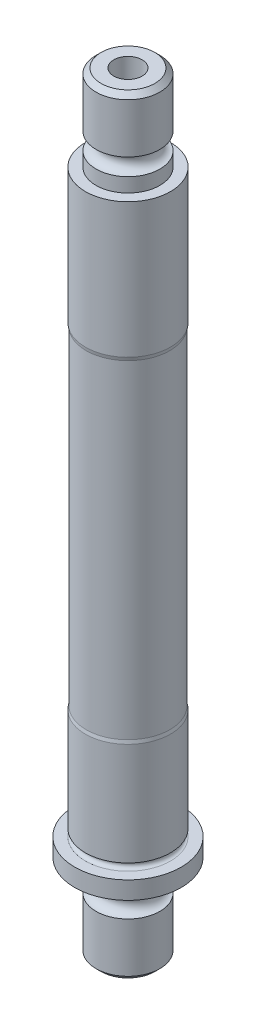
ISO-10303-21;
HEADER;
FILE_DESCRIPTION(('STEP AP214'),'2;1');
FILE_NAME('part.step','',(''),(''),'','','');
FILE_SCHEMA(('AUTOMOTIVE_DESIGN { 1 0 10303 214 1 1 1 1 }'));
ENDSEC;
DATA;
#1=APPLICATION_CONTEXT('core data for automotive mechanical design processes');
#2=APPLICATION_PROTOCOL_DEFINITION('international standard','automotive_design',2000,#1);
#3=PRODUCT_CONTEXT('',#1,'mechanical');
#4=PRODUCT('Part','Part','',(#3));
#5=PRODUCT_RELATED_PRODUCT_CATEGORY('part','',(#4));
#6=PRODUCT_DEFINITION_FORMATION('','',#4);
#7=PRODUCT_DEFINITION_CONTEXT('part definition',#1,'design');
#8=PRODUCT_DEFINITION('design','',#6,#7);
#9=PRODUCT_DEFINITION_SHAPE('','',#8);
#10=(LENGTH_UNIT() NAMED_UNIT(*) SI_UNIT(.MILLI.,.METRE.));
#11=(NAMED_UNIT(*) PLANE_ANGLE_UNIT() SI_UNIT($,.RADIAN.));
#12=(NAMED_UNIT(*) SI_UNIT($,.STERADIAN.) SOLID_ANGLE_UNIT());
#13=UNCERTAINTY_MEASURE_WITH_UNIT(LENGTH_MEASURE(1.E-05),#10,'distance_accuracy_value','');
#14=(GEOMETRIC_REPRESENTATION_CONTEXT(3) GLOBAL_UNCERTAINTY_ASSIGNED_CONTEXT((#13)) GLOBAL_UNIT_ASSIGNED_CONTEXT((#10,
#11,#12)) REPRESENTATION_CONTEXT('',''));
#15=CARTESIAN_POINT('',(0.,0.,0.));
#16=DIRECTION('',(0.,0.,1.));
#17=DIRECTION('',(1.,0.,0.));
#18=AXIS2_PLACEMENT_3D('',#15,#16,#17);
#19=CARTESIAN_POINT('',(0.,-108.5,0.));
#20=DIRECTION('',(0.,1.,0.));
#21=DIRECTION('',(0.,0.,1.));
#22=AXIS2_PLACEMENT_3D('',#19,#20,#21);
#23=PLANE('',#22);
#24=CARTESIAN_POINT('',(0.,-108.5,0.));
#25=DIRECTION('',(0.,-1.,0.));
#26=DIRECTION('',(0.,0.,-1.));
#27=AXIS2_PLACEMENT_3D('',#24,#25,#26);
#28=CIRCLE('',#27,2.);
#29=CARTESIAN_POINT('',(0.,-108.5,-2.));
#30=VERTEX_POINT('',#29);
#31=EDGE_CURVE('E125',#30,#30,#28,.F.);
#32=ORIENTED_EDGE('',*,*,#31,.T.);
#33=EDGE_LOOP('',(#32));
#34=FACE_BOUND('',#33,.T.);
#35=CARTESIAN_POINT('',(0.,-108.499999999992,0.));
#36=DIRECTION('',(0.,1.,0.));
#37=DIRECTION('',(0.,0.,1.));
#38=AXIS2_PLACEMENT_3D('',#35,#36,#37);
#39=CIRCLE('',#38,3.79289321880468);
#40=CARTESIAN_POINT('',(0.,-108.499999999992,3.79289321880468));
#41=VERTEX_POINT('',#40);
#42=EDGE_CURVE('E128',#41,#41,#39,.T.);
#43=ORIENTED_EDGE('',*,*,#42,.F.);
#44=EDGE_LOOP('',(#43));
#45=FACE_BOUND('',#44,.T.);
#46=ADVANCED_FACE('F16',(#34,#45),#23,.F.);
#47=CARTESIAN_POINT('',(0.,-107.792893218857,0.));
#48=DIRECTION('',(0.,1.,0.));
#49=DIRECTION('',(0.,0.,1.));
#50=AXIS2_PLACEMENT_3D('',#47,#48,#49);
#51=CONICAL_SURFACE('',#50,4.49999999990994,0.785398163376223);
#52=ORIENTED_EDGE('',*,*,#42,.T.);
#53=EDGE_LOOP('',(#52));
#54=FACE_BOUND('',#53,.T.);
#55=CARTESIAN_POINT('',(0.,-107.792893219,0.));
#56=DIRECTION('',(0.,1.,0.));
#57=DIRECTION('',(0.,0.,1.));
#58=AXIS2_PLACEMENT_3D('',#55,#56,#57);
#59=CIRCLE('',#58,4.5);
#60=CARTESIAN_POINT('',(0.,-107.792893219,4.5));
#61=VERTEX_POINT('',#60);
#62=EDGE_CURVE('E102',#61,#61,#59,.T.);
#63=ORIENTED_EDGE('',*,*,#62,.F.);
#64=EDGE_LOOP('',(#63));
#65=FACE_BOUND('',#64,.T.);
#66=ADVANCED_FACE('F132',(#54,#65),#51,.T.);
#67=CARTESIAN_POINT('',(0.,-53.5899999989,0.));
#68=DIRECTION('',(0.,-1.,0.));
#69=DIRECTION('',(0.,0.,-1.));
#70=AXIS2_PLACEMENT_3D('',#67,#68,#69);
#71=CYLINDRICAL_SURFACE('',#70,2.);
#72=ORIENTED_EDGE('',*,*,#31,.F.);
#73=EDGE_LOOP('',(#72));
#74=FACE_BOUND('',#73,.T.);
#75=CARTESIAN_POINT('',(0.,0.,0.));
#76=DIRECTION('',(0.,-1.,0.));
#77=DIRECTION('',(0.,0.,-1.));
#78=AXIS2_PLACEMENT_3D('',#75,#76,#77);
#79=CIRCLE('',#78,2.);
#80=CARTESIAN_POINT('',(0.,0.,-2.));
#81=VERTEX_POINT('',#80);
#82=EDGE_CURVE('E122',#81,#81,#79,.T.);
#83=ORIENTED_EDGE('',*,*,#82,.F.);
#84=EDGE_LOOP('',(#83));
#85=FACE_BOUND('',#84,.T.);
#86=ADVANCED_FACE('F141',(#74,#85),#71,.F.);
#87=CARTESIAN_POINT('',(0.,-54.25,0.));
#88=DIRECTION('',(0.,1.,0.));
#89=DIRECTION('',(0.,0.,1.));
#90=AXIS2_PLACEMENT_3D('',#87,#88,#89);
#91=CYLINDRICAL_SURFACE('',#90,4.5);
#92=ORIENTED_EDGE('',*,*,#62,.T.);
#93=EDGE_LOOP('',(#92));
#94=FACE_BOUND('',#93,.T.);
#95=CARTESIAN_POINT('',(0.,-100.7928932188,0.));
#96=DIRECTION('',(0.,1.,0.));
#97=DIRECTION('',(0.479425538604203,0.,0.877582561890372));
#98=AXIS2_PLACEMENT_3D('',#95,#96,#97);
#99=CIRCLE('',#98,4.50000000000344);
#100=CARTESIAN_POINT('',(2.15741492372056,-100.7928932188,3.94912152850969));
#101=VERTEX_POINT('',#100);
#102=EDGE_CURVE('E121',#101,#101,#99,.F.);
#103=ORIENTED_EDGE('',*,*,#102,.T.);
#104=EDGE_LOOP('',(#103));
#105=FACE_BOUND('',#104,.T.);
#106=ADVANCED_FACE('F264',(#94,#105),#91,.T.);
#107=CARTESIAN_POINT('',(0.,0.,3.79289321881));
#108=DIRECTION('',(0.,1.,0.));
#109=DIRECTION('',(0.,0.,1.));
#110=AXIS2_PLACEMENT_3D('',#107,#108,#109);
#111=PLANE('',#110);
#112=ORIENTED_EDGE('',*,*,#82,.T.);
#113=EDGE_LOOP('',(#112));
#114=FACE_BOUND('',#113,.T.);
#115=CARTESIAN_POINT('',(0.,0.,0.));
#116=DIRECTION('',(0.,-1.,0.));
#117=DIRECTION('',(0.,0.,-1.));
#118=AXIS2_PLACEMENT_3D('',#115,#116,#117);
#119=CIRCLE('',#118,3.79289321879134);
#120=CARTESIAN_POINT('',(0.,0.,-3.79289321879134));
#121=VERTEX_POINT('',#120);
#122=EDGE_CURVE('E117',#121,#121,#119,.T.);
#123=ORIENTED_EDGE('',*,*,#122,.F.);
#124=EDGE_LOOP('',(#123));
#125=FACE_BOUND('',#124,.T.);
#126=ADVANCED_FACE('F256',(#114,#125),#111,.T.);
#127=CARTESIAN_POINT('',(0.,-99.5928932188,0.));
#128=DIRECTION('',(0.,1.,0.));
#129=DIRECTION('',(0.479425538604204,0.,0.877582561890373));
#130=AXIS2_PLACEMENT_3D('',#127,#128,#129);
#131=TOROIDAL_SURFACE('',#130,4.5,1.2);
#132=ORIENTED_EDGE('',*,*,#102,.F.);
#133=EDGE_LOOP('',(#132));
#134=FACE_BOUND('',#133,.T.);
#135=CARTESIAN_POINT('',(0.,-98.3928932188,0.));
#136=DIRECTION('',(0.,1.,0.));
#137=DIRECTION('',(0.,0.,1.));
#138=AXIS2_PLACEMENT_3D('',#135,#136,#137);
#139=CIRCLE('',#138,4.5);
#140=CARTESIAN_POINT('',(0.,-98.3928932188,4.5));
#141=VERTEX_POINT('',#140);
#142=EDGE_CURVE('E120',#141,#141,#139,.T.);
#143=ORIENTED_EDGE('',*,*,#142,.F.);
#144=EDGE_LOOP('',(#143));
#145=FACE_BOUND('',#144,.T.);
#146=ADVANCED_FACE('F248',(#134,#145),#131,.F.);
#147=CARTESIAN_POINT('',(0.,-0.707106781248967,0.));
#148=DIRECTION('',(0.,-1.,0.));
#149=DIRECTION('',(0.,0.,-1.));
#150=AXIS2_PLACEMENT_3D('',#147,#148,#149);
#151=CONICAL_SURFACE('',#150,4.5000000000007,0.785398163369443);
#152=CARTESIAN_POINT('',(0.,-0.707106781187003,0.));
#153=DIRECTION('',(0.,1.,0.));
#154=DIRECTION('',(0.,0.,1.));
#155=AXIS2_PLACEMENT_3D('',#152,#153,#154);
#156=CIRCLE('',#155,4.5);
#157=CARTESIAN_POINT('',(0.,-0.707106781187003,4.5));
#158=VERTEX_POINT('',#157);
#159=EDGE_CURVE('E116',#158,#158,#156,.F.);
#160=ORIENTED_EDGE('',*,*,#159,.F.);
#161=EDGE_LOOP('',(#160));
#162=FACE_BOUND('',#161,.T.);
#163=ORIENTED_EDGE('',*,*,#122,.T.);
#164=EDGE_LOOP('',(#163));
#165=FACE_BOUND('',#164,.T.);
#166=ADVANCED_FACE('F240',(#162,#165),#151,.T.);
#167=CARTESIAN_POINT('',(0.,-54.25,0.));
#168=DIRECTION('',(0.,1.,0.));
#169=DIRECTION('',(0.,0.,1.));
#170=AXIS2_PLACEMENT_3D('',#167,#168,#169);
#171=CYLINDRICAL_SURFACE('',#170,4.5);
#172=ORIENTED_EDGE('',*,*,#142,.T.);
#173=EDGE_LOOP('',(#172));
#174=FACE_BOUND('',#173,.T.);
#175=CARTESIAN_POINT('',(0.,-96.3928932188,0.));
#176=DIRECTION('',(0.,1.,0.));
#177=DIRECTION('',(0.,0.,1.));
#178=AXIS2_PLACEMENT_3D('',#175,#176,#177);
#179=CIRCLE('',#178,4.5);
#180=CARTESIAN_POINT('',(0.,-96.3928932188,4.5));
#181=VERTEX_POINT('',#180);
#182=EDGE_CURVE('E113',#181,#181,#179,.F.);
#183=ORIENTED_EDGE('',*,*,#182,.T.);
#184=EDGE_LOOP('',(#183));
#185=FACE_BOUND('',#184,.T.);
#186=ADVANCED_FACE('F232',(#174,#185),#171,.T.);
#187=CARTESIAN_POINT('',(0.,-54.25,0.));
#188=DIRECTION('',(0.,1.,0.));
#189=DIRECTION('',(0.,0.,1.));
#190=AXIS2_PLACEMENT_3D('',#187,#188,#189);
#191=CYLINDRICAL_SURFACE('',#190,4.5);
#192=CARTESIAN_POINT('',(0.,-7.70710678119,0.));
#193=DIRECTION('',(0.,1.,0.));
#194=DIRECTION('',(0.479425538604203,0.,0.877582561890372));
#195=AXIS2_PLACEMENT_3D('',#192,#193,#194);
#196=CIRCLE('',#195,4.50000000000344);
#197=CARTESIAN_POINT('',(2.15741492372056,-7.70710678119,3.94912152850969));
#198=VERTEX_POINT('',#197);
#199=EDGE_CURVE('E112',#198,#198,#196,.T.);
#200=ORIENTED_EDGE('',*,*,#199,.T.);
#201=EDGE_LOOP('',(#200));
#202=FACE_BOUND('',#201,.T.);
#203=ORIENTED_EDGE('',*,*,#159,.T.);
#204=EDGE_LOOP('',(#203));
#205=FACE_BOUND('',#204,.T.);
#206=ADVANCED_FACE('F224',(#202,#205),#191,.T.);
#207=CARTESIAN_POINT('',(0.,-96.3928932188,4.5));
#208=DIRECTION('',(0.,1.,0.));
#209=DIRECTION('',(0.,0.,1.));
#210=AXIS2_PLACEMENT_3D('',#207,#208,#209);
#211=PLANE('',#210);
#212=ORIENTED_EDGE('',*,*,#182,.F.);
#213=EDGE_LOOP('',(#212));
#214=FACE_BOUND('',#213,.T.);
#215=CARTESIAN_POINT('',(0.,-96.3928932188,0.));
#216=DIRECTION('',(0.,1.,0.));
#217=DIRECTION('',(0.,0.,1.));
#218=AXIS2_PLACEMENT_3D('',#215,#216,#217);
#219=CIRCLE('',#218,7.5);
#220=CARTESIAN_POINT('',(0.,-96.3928932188,7.5));
#221=VERTEX_POINT('',#220);
#222=EDGE_CURVE('E109',#221,#221,#219,.T.);
#223=ORIENTED_EDGE('',*,*,#222,.F.);
#224=EDGE_LOOP('',(#223));
#225=FACE_BOUND('',#224,.T.);
#226=ADVANCED_FACE('F216',(#214,#225),#211,.F.);
#227=CARTESIAN_POINT('',(0.,-8.90710678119,0.));
#228=DIRECTION('',(0.,1.,0.));
#229=DIRECTION('',(0.479425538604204,0.,0.877582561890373));
#230=AXIS2_PLACEMENT_3D('',#227,#228,#229);
#231=TOROIDAL_SURFACE('',#230,4.5,1.2);
#232=CARTESIAN_POINT('',(0.,-10.1071067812,0.));
#233=DIRECTION('',(0.,1.,0.));
#234=DIRECTION('',(0.,0.,1.));
#235=AXIS2_PLACEMENT_3D('',#232,#233,#234);
#236=CIRCLE('',#235,4.5);
#237=CARTESIAN_POINT('',(0.,-10.1071067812,4.5));
#238=VERTEX_POINT('',#237);
#239=EDGE_CURVE('E108',#238,#238,#236,.F.);
#240=ORIENTED_EDGE('',*,*,#239,.F.);
#241=EDGE_LOOP('',(#240));
#242=FACE_BOUND('',#241,.T.);
#243=ORIENTED_EDGE('',*,*,#199,.F.);
#244=EDGE_LOOP('',(#243));
#245=FACE_BOUND('',#244,.T.);
#246=ADVANCED_FACE('F208',(#242,#245),#231,.F.);
#247=CARTESIAN_POINT('',(0.,-54.25,0.));
#248=DIRECTION('',(0.,1.,0.));
#249=DIRECTION('',(0.,0.,1.));
#250=AXIS2_PLACEMENT_3D('',#247,#248,#249);
#251=CYLINDRICAL_SURFACE('',#250,7.5);
#252=ORIENTED_EDGE('',*,*,#222,.T.);
#253=EDGE_LOOP('',(#252));
#254=FACE_BOUND('',#253,.T.);
#255=CARTESIAN_POINT('',(0.,-93.8928932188,0.));
#256=DIRECTION('',(0.,1.,0.));
#257=DIRECTION('',(0.,0.,1.));
#258=AXIS2_PLACEMENT_3D('',#255,#256,#257);
#259=CIRCLE('',#258,7.5);
#260=CARTESIAN_POINT('',(0.,-93.8928932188,7.5));
#261=VERTEX_POINT('',#260);
#262=EDGE_CURVE('E42',#261,#261,#259,.T.);
#263=ORIENTED_EDGE('',*,*,#262,.F.);
#264=EDGE_LOOP('',(#263));
#265=FACE_BOUND('',#264,.T.);
#266=ADVANCED_FACE('F200',(#254,#265),#251,.T.);
#267=CARTESIAN_POINT('',(0.,-54.25,0.));
#268=DIRECTION('',(0.,1.,0.));
#269=DIRECTION('',(0.,0.,1.));
#270=AXIS2_PLACEMENT_3D('',#267,#268,#269);
#271=CYLINDRICAL_SURFACE('',#270,4.5);
#272=CARTESIAN_POINT('',(0.,-12.1071067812,0.));
#273=DIRECTION('',(0.,1.,0.));
#274=DIRECTION('',(0.,0.,1.));
#275=AXIS2_PLACEMENT_3D('',#272,#273,#274);
#276=CIRCLE('',#275,4.5);
#277=CARTESIAN_POINT('',(0.,-12.1071067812,4.5));
#278=VERTEX_POINT('',#277);
#279=EDGE_CURVE('E41',#278,#278,#276,.F.);
#280=ORIENTED_EDGE('',*,*,#279,.F.);
#281=EDGE_LOOP('',(#280));
#282=FACE_BOUND('',#281,.T.);
#283=ORIENTED_EDGE('',*,*,#239,.T.);
#284=EDGE_LOOP('',(#283));
#285=FACE_BOUND('',#284,.T.);
#286=ADVANCED_FACE('F194',(#282,#285),#271,.T.);
#287=CARTESIAN_POINT('',(0.,-93.8928932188,7.5));
#288=DIRECTION('',(0.,1.,0.));
#289=DIRECTION('',(0.,0.,1.));
#290=AXIS2_PLACEMENT_3D('',#287,#288,#289);
#291=PLANE('',#290);
#292=CARTESIAN_POINT('',(0.,-93.8928932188,0.));
#293=DIRECTION('',(0.,1.,0.));
#294=DIRECTION('',(0.479425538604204,0.,0.877582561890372));
#295=AXIS2_PLACEMENT_3D('',#292,#293,#294);
#296=CIRCLE('',#295,6.00000000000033);
#297=CARTESIAN_POINT('',(-2.87655323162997,-93.8928932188,-5.26549537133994));
#298=VERTEX_POINT('',#297);
#299=CARTESIAN_POINT('',(2.8765532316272,-93.8928932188,5.26549537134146));
#300=VERTEX_POINT('',#299);
#301=EDGE_CURVE('E36',#298,#300,#296,.F.);
#302=ORIENTED_EDGE('',*,*,#301,.T.);
#303=CARTESIAN_POINT('',(0.,-93.8928932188,0.));
#304=DIRECTION('',(0.,1.,0.));
#305=DIRECTION('',(-0.479425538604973,0.,-0.877582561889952));
#306=AXIS2_PLACEMENT_3D('',#303,#304,#305);
#307=CIRCLE('',#306,6.00000000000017);
#308=EDGE_CURVE('E33',#300,#298,#307,.F.);
#309=ORIENTED_EDGE('',*,*,#308,.T.);
#310=EDGE_LOOP('',(#302,#309));
#311=FACE_BOUND('',#310,.T.);
#312=ORIENTED_EDGE('',*,*,#262,.T.);
#313=EDGE_LOOP('',(#312));
#314=FACE_BOUND('',#313,.T.);
#315=ADVANCED_FACE('F38',(#311,#314),#291,.T.);
#316=CARTESIAN_POINT('',(0.,-12.1071067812,6.));
#317=DIRECTION('',(0.,1.,0.));
#318=DIRECTION('',(0.,0.,1.));
#319=AXIS2_PLACEMENT_3D('',#316,#317,#318);
#320=PLANE('',#319);
#321=ORIENTED_EDGE('',*,*,#279,.T.);
#322=EDGE_LOOP('',(#321));
#323=FACE_BOUND('',#322,.T.);
#324=CARTESIAN_POINT('',(0.,-12.1071067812,0.));
#325=DIRECTION('',(0.,1.,0.));
#326=DIRECTION('',(0.,0.,1.));
#327=AXIS2_PLACEMENT_3D('',#324,#325,#326);
#328=CIRCLE('',#327,6.);
#329=CARTESIAN_POINT('',(0.,-12.1071067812,6.));
#330=VERTEX_POINT('',#329);
#331=EDGE_CURVE('E48',#330,#330,#328,.F.);
#332=ORIENTED_EDGE('',*,*,#331,.F.);
#333=EDGE_LOOP('',(#332));
#334=FACE_BOUND('',#333,.T.);
#335=ADVANCED_FACE('F69',(#323,#334),#320,.T.);
#336=CARTESIAN_POINT('',(0.,-93.3928932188,0.));
#337=DIRECTION('',(0.,1.,0.));
#338=DIRECTION('',(0.479425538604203,0.,0.877582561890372));
#339=AXIS2_PLACEMENT_3D('',#336,#337,#338);
#340=TOROIDAL_SURFACE('',#339,6.,0.5);
#341=ORIENTED_EDGE('',*,*,#308,.F.);
#342=ORIENTED_EDGE('',*,*,#301,.F.);
#343=EDGE_LOOP('',(#341,#342));
#344=FACE_BOUND('',#343,.T.);
#345=CARTESIAN_POINT('',(0.,-92.8928932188,0.));
#346=DIRECTION('',(0.,1.,0.));
#347=DIRECTION('',(0.,0.,1.));
#348=AXIS2_PLACEMENT_3D('',#345,#346,#347);
#349=CIRCLE('',#348,6.);
#350=CARTESIAN_POINT('',(0.,-92.8928932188,6.));
#351=VERTEX_POINT('',#350);
#352=EDGE_CURVE('E57',#351,#351,#349,.T.);
#353=ORIENTED_EDGE('',*,*,#352,.F.);
#354=EDGE_LOOP('',(#353));
#355=FACE_BOUND('',#354,.T.);
#356=ADVANCED_FACE('F46',(#344,#355),#340,.F.);
#357=CARTESIAN_POINT('',(0.,-54.25,0.));
#358=DIRECTION('',(0.,1.,0.));
#359=DIRECTION('',(0.,0.,1.));
#360=AXIS2_PLACEMENT_3D('',#357,#358,#359);
#361=CYLINDRICAL_SURFACE('',#360,6.);
#362=CARTESIAN_POINT('',(0.,-31.1071067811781,0.));
#363=DIRECTION('',(0.,1.,0.));
#364=DIRECTION('',(0.479425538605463,0.,0.877582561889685));
#365=AXIS2_PLACEMENT_3D('',#362,#363,#364);
#366=CIRCLE('',#365,5.99999999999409);
#367=CARTESIAN_POINT('',(2.87655323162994,-31.1071067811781,5.26549537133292));
#368=VERTEX_POINT('',#367);
#369=EDGE_CURVE('E74',#368,#368,#366,.F.);
#370=ORIENTED_EDGE('',*,*,#369,.F.);
#371=EDGE_LOOP('',(#370));
#372=FACE_BOUND('',#371,.T.);
#373=ORIENTED_EDGE('',*,*,#331,.T.);
#374=EDGE_LOOP('',(#373));
#375=FACE_BOUND('',#374,.T.);
#376=ADVANCED_FACE('F68',(#372,#375),#361,.T.);
#377=CARTESIAN_POINT('',(0.,-54.25,0.));
#378=DIRECTION('',(0.,1.,0.));
#379=DIRECTION('',(0.,0.,1.));
#380=AXIS2_PLACEMENT_3D('',#377,#378,#379);
#381=CYLINDRICAL_SURFACE('',#380,6.);
#382=ORIENTED_EDGE('',*,*,#352,.T.);
#383=EDGE_LOOP('',(#382));
#384=FACE_BOUND('',#383,.T.);
#385=CARTESIAN_POINT('',(0.,-78.3928932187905,0.));
#386=DIRECTION('',(0.,-1.,0.));
#387=DIRECTION('',(0.479425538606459,0.,0.87758256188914));
#388=AXIS2_PLACEMENT_3D('',#385,#386,#387);
#389=CIRCLE('',#388,5.99999999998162);
#390=CARTESIAN_POINT('',(2.87655323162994,-78.3928932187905,5.26549537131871));
#391=VERTEX_POINT('',#390);
#392=EDGE_CURVE('E77',#391,#391,#389,.F.);
#393=ORIENTED_EDGE('',*,*,#392,.F.);
#394=EDGE_LOOP('',(#393));
#395=FACE_BOUND('',#394,.T.);
#396=ADVANCED_FACE('F89',(#384,#395),#381,.T.);
#397=CARTESIAN_POINT('',(0.,-31.1071067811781,0.));
#398=DIRECTION('',(0.,1.,0.));
#399=DIRECTION('',(0.,0.,1.));
#400=AXIS2_PLACEMENT_3D('',#397,#398,#399);
#401=CONICAL_SURFACE('',#400,5.99999999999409,0.201357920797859);
#402=CARTESIAN_POINT('',(0.,-31.5970047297,0.));
#403=DIRECTION('',(0.,1.,0.));
#404=DIRECTION('',(0.,0.,1.));
#405=AXIS2_PLACEMENT_3D('',#402,#403,#404);
#406=CIRCLE('',#405,5.9);
#407=CARTESIAN_POINT('',(0.,-31.5970047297,5.9));
#408=VERTEX_POINT('',#407);
#409=EDGE_CURVE('E26',#408,#408,#406,.F.);
#410=ORIENTED_EDGE('',*,*,#409,.F.);
#411=EDGE_LOOP('',(#410));
#412=FACE_BOUND('',#411,.T.);
#413=ORIENTED_EDGE('',*,*,#369,.T.);
#414=EDGE_LOOP('',(#413));
#415=FACE_BOUND('',#414,.T.);
#416=ADVANCED_FACE('F85',(#412,#415),#401,.T.);
#417=CARTESIAN_POINT('',(0.,-78.3928932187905,0.));
#418=DIRECTION('',(0.,-1.,0.));
#419=DIRECTION('',(0.,0.,-1.));
#420=AXIS2_PLACEMENT_3D('',#417,#418,#419);
#421=CONICAL_SURFACE('',#420,5.99999999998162,0.201357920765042);
#422=ORIENTED_EDGE('',*,*,#392,.T.);
#423=EDGE_LOOP('',(#422));
#424=FACE_BOUND('',#423,.T.);
#425=CARTESIAN_POINT('',(0.,-77.9029952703,0.));
#426=DIRECTION('',(0.,1.,0.));
#427=DIRECTION('',(0.,0.,1.));
#428=AXIS2_PLACEMENT_3D('',#425,#426,#427);
#429=CIRCLE('',#428,5.9);
#430=CARTESIAN_POINT('',(0.,-77.9029952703,5.9));
#431=VERTEX_POINT('',#430);
#432=EDGE_CURVE('E10',#431,#431,#429,.T.);
#433=ORIENTED_EDGE('',*,*,#432,.F.);
#434=EDGE_LOOP('',(#433));
#435=FACE_BOUND('',#434,.T.);
#436=ADVANCED_FACE('F88',(#424,#435),#421,.T.);
#437=CARTESIAN_POINT('',(0.,-54.25,0.));
#438=DIRECTION('',(0.,1.,0.));
#439=DIRECTION('',(0.,0.,1.));
#440=AXIS2_PLACEMENT_3D('',#437,#438,#439);
#441=CYLINDRICAL_SURFACE('',#440,5.9);
#442=ORIENTED_EDGE('',*,*,#432,.T.);
#443=EDGE_LOOP('',(#442));
#444=FACE_BOUND('',#443,.T.);
#445=ORIENTED_EDGE('',*,*,#409,.T.);
#446=EDGE_LOOP('',(#445));
#447=FACE_BOUND('',#446,.T.);
#448=ADVANCED_FACE('F83',(#444,#447),#441,.T.);
#449=CLOSED_SHELL('',(#46,#66,#86,#106,#126,#146,#166,#186,#206,#226,#246,#266,#286,#315,#335,
#356,#376,#396,#416,#436,#448));
#450=MANIFOLD_SOLID_BREP('B1',#449);
#451=ADVANCED_BREP_SHAPE_REPRESENTATION('',(#18,#450),#14);
#452=SHAPE_DEFINITION_REPRESENTATION(#9,#451);
ENDSEC;
END-ISO-10303-21;
